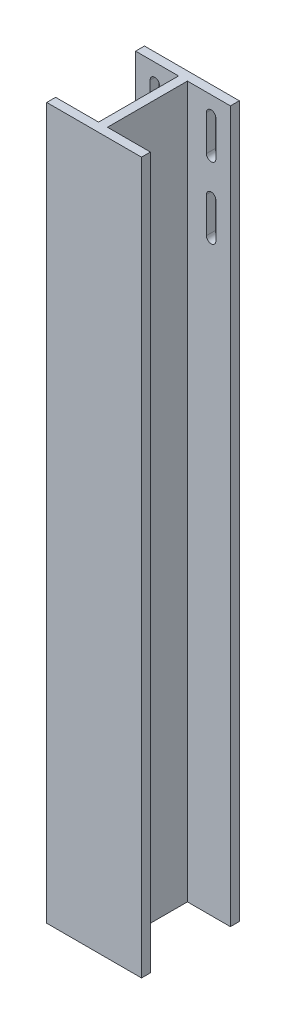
from build123d import *

# Parameters (mm, degrees)
BOSS_EXTRUDE1_L_26IN_DEPTH     = 762
CUT_EXTRUDE1_REACH             = 777.851
CUT_EXTRUDE1_DIRECTION_2_DEPTH = 776.850733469


with BuildPart() as part:
    # Sketch1 → Boss-Extrude1 L_26in (new body)
    with BuildSketch(Plane(origin=(0, 0, 0), x_dir=(1, 0, 0), z_dir=(0, 1, 0))):
        Polygon((0, 0), (101.6, 0), (101.6, 9.525), (55.5625, 9.525), (55.5625, 95.25), (101.6, 95.25), (101.6, 104.775), (0, 104.775), (0, 95.25), (46.0375, 95.25), (46.0375, 9.525), (0, 9.525), align=None)
    extrude(amount=BOSS_EXTRUDE1_L_26IN_DEPTH)

    # Sketch6 → Cut-Extrude1 (cut, up to next)
    with BuildSketch(Plane(origin=(0, 0, -104.775), x_dir=(-1, 0, 0), z_dir=(0, 0, -1)), mode=Mode.PRIVATE) as cut_extrude1_sk1:
        with BuildLine():
            Line((-75.9206, 742.95), (-75.9206, 704.85))
            ThreePointArc((-75.9206, 704.85), (-80.9625, 699.8081), (-86.0044, 704.85))
            Line((-86.0044, 704.85), (-86.0044, 742.95))
            ThreePointArc((-86.0044, 742.95), (-80.9625, 747.9919), (-75.9206, 742.95))
        make_face()
    cut_extrude1_tool1 = extrude(cut_extrude1_sk1.sketch, amount=-CUT_EXTRUDE1_REACH, mode=Mode.PRIVATE) & part.part
    # Sketch6 → Cut-Extrude1 (cut, up to next)
    with BuildSketch(Plane(origin=(0, 0, -104.775), x_dir=(-1, 0, 0), z_dir=(0, 0, -1)), mode=Mode.PRIVATE) as cut_extrude1_sk2:
        with BuildLine():
            Line((-25.6794, 704.85), (-25.6794, 742.95))
            ThreePointArc((-25.6794, 742.95), (-20.6375, 747.9919), (-15.5956, 742.95))
            Line((-15.5956, 742.95), (-15.5956, 704.85))
            ThreePointArc((-15.5956, 704.85), (-20.6375, 699.8081), (-25.6794, 704.85))
        make_face()
    cut_extrude1_tool2 = extrude(cut_extrude1_sk2.sketch, amount=-CUT_EXTRUDE1_REACH, mode=Mode.PRIVATE) & part.part
    # Sketch6 → Cut-Extrude1 (cut, up to next)
    with BuildSketch(Plane(origin=(0, 0, -104.775), x_dir=(-1, 0, 0), z_dir=(0, 0, -1)), mode=Mode.PRIVATE) as cut_extrude1_sk3:
        with BuildLine():
            Line((-25.6794, 628.65), (-25.6794, 666.75))
            ThreePointArc((-25.6794, 666.75), (-20.6375, 671.7919), (-15.5956, 666.75))
            Line((-15.5956, 666.75), (-15.5956, 628.65))
            ThreePointArc((-15.5956, 628.65), (-20.6375, 623.6081), (-25.6794, 628.65))
        make_face()
    cut_extrude1_tool3 = extrude(cut_extrude1_sk3.sketch, amount=-CUT_EXTRUDE1_REACH, mode=Mode.PRIVATE) & part.part
    # Sketch6 → Cut-Extrude1 (cut, up to next)
    with BuildSketch(Plane(origin=(0, 0, -104.775), x_dir=(-1, 0, 0), z_dir=(0, 0, -1)), mode=Mode.PRIVATE) as cut_extrude1_sk4:
        with BuildLine():
            Line((-86.0044, 628.65), (-86.0044, 666.75))
            ThreePointArc((-86.0044, 666.75), (-80.9625, 671.7919), (-75.9206, 666.75))
            Line((-75.9206, 666.75), (-75.9206, 628.65))
            ThreePointArc((-75.9206, 628.65), (-80.9625, 623.6081), (-86.0044, 628.65))
        make_face()
    cut_extrude1_tool4 = extrude(cut_extrude1_sk4.sketch, amount=-CUT_EXTRUDE1_REACH, mode=Mode.PRIVATE) & part.part
    add(cut_extrude1_tool1.solids().sort_by_distance((80.9625, 723.9, -104.775))[0], mode=Mode.SUBTRACT)
    add(cut_extrude1_tool2.solids().sort_by_distance((20.6375, 723.9, -104.775))[0], mode=Mode.SUBTRACT)
    add(cut_extrude1_tool3.solids().sort_by_distance((20.6375, 647.7, -104.775))[0], mode=Mode.SUBTRACT)
    add(cut_extrude1_tool4.solids().sort_by_distance((80.9625, 647.7, -104.775))[0], mode=Mode.SUBTRACT)

    # Sketch6 → Cut-Extrude1 direction 2 (cut)
    with BuildSketch(Plane(origin=(0, 0, -104.775), x_dir=(-1, 0, 0), z_dir=(0, 0, -1))):
        with BuildLine():
            Line((-75.9206, 742.95), (-75.9206, 704.85))
            ThreePointArc((-75.9206, 704.85), (-80.9625, 699.8081), (-86.0044, 704.85))
            Line((-86.0044, 704.85), (-86.0044, 742.95))
            ThreePointArc((-86.0044, 742.95), (-80.9625, 747.9919), (-75.9206, 742.95))
        make_face()
        with BuildLine():
            Line((-25.6794, 704.85), (-25.6794, 742.95))
            ThreePointArc((-25.6794, 742.95), (-20.6375, 747.9919), (-15.5956, 742.95))
            Line((-15.5956, 742.95), (-15.5956, 704.85))
            ThreePointArc((-15.5956, 704.85), (-20.6375, 699.8081), (-25.6794, 704.85))
        make_face()
        with BuildLine():
            Line((-25.6794, 628.65), (-25.6794, 666.75))
            ThreePointArc((-25.6794, 666.75), (-20.6375, 671.7919), (-15.5956, 666.75))
            Line((-15.5956, 666.75), (-15.5956, 628.65))
            ThreePointArc((-15.5956, 628.65), (-20.6375, 623.6081), (-25.6794, 628.65))
        make_face()
        with BuildLine():
            Line((-86.0044, 628.65), (-86.0044, 666.75))
            ThreePointArc((-86.0044, 666.75), (-80.9625, 671.7919), (-75.9206, 666.75))
            Line((-75.9206, 666.75), (-75.9206, 628.65))
            ThreePointArc((-75.9206, 628.65), (-80.9625, 623.6081), (-86.0044, 628.65))
        make_face()
    extrude(amount=CUT_EXTRUDE1_DIRECTION_2_DEPTH, mode=Mode.SUBTRACT)


solid = part.part
